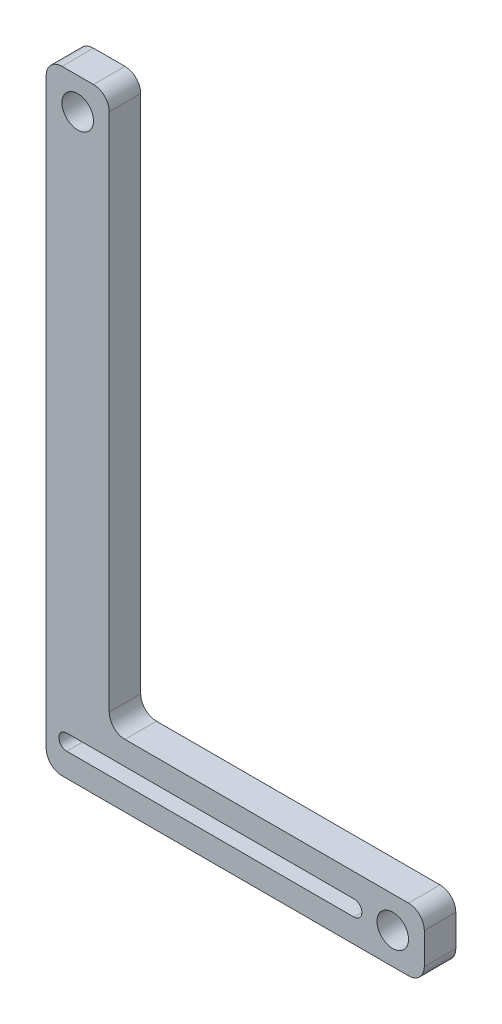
ISO-10303-21;
HEADER;
FILE_DESCRIPTION(('STEP AP214'),'2;1');
FILE_NAME('part.step','',(''),(''),'','','');
FILE_SCHEMA(('AUTOMOTIVE_DESIGN { 1 0 10303 214 1 1 1 1 }'));
ENDSEC;
DATA;
#1=APPLICATION_CONTEXT('core data for automotive mechanical design processes');
#2=APPLICATION_PROTOCOL_DEFINITION('international standard','automotive_design',2000,#1);
#3=PRODUCT_CONTEXT('',#1,'mechanical');
#4=PRODUCT('Part','Part','',(#3));
#5=PRODUCT_RELATED_PRODUCT_CATEGORY('part','',(#4));
#6=PRODUCT_DEFINITION_FORMATION('','',#4);
#7=PRODUCT_DEFINITION_CONTEXT('part definition',#1,'design');
#8=PRODUCT_DEFINITION('design','',#6,#7);
#9=PRODUCT_DEFINITION_SHAPE('','',#8);
#10=(LENGTH_UNIT() NAMED_UNIT(*) SI_UNIT(.MILLI.,.METRE.));
#11=(NAMED_UNIT(*) PLANE_ANGLE_UNIT() SI_UNIT($,.RADIAN.));
#12=(NAMED_UNIT(*) SI_UNIT($,.STERADIAN.) SOLID_ANGLE_UNIT());
#13=UNCERTAINTY_MEASURE_WITH_UNIT(LENGTH_MEASURE(1.E-05),#10,'distance_accuracy_value','');
#14=(GEOMETRIC_REPRESENTATION_CONTEXT(3) GLOBAL_UNCERTAINTY_ASSIGNED_CONTEXT((#13)) GLOBAL_UNIT_ASSIGNED_CONTEXT((#10,
#11,#12)) REPRESENTATION_CONTEXT('',''));
#15=CARTESIAN_POINT('',(0.,0.,0.));
#16=DIRECTION('',(0.,0.,1.));
#17=DIRECTION('',(1.,0.,0.));
#18=AXIS2_PLACEMENT_3D('',#15,#16,#17);
#19=CARTESIAN_POINT('',(0.,0.,-12.7));
#20=DIRECTION('',(0.,-1.,0.));
#21=DIRECTION('',(0.,0.,-1.));
#22=AXIS2_PLACEMENT_3D('',#19,#20,#21);
#23=PLANE('',#22);
#24=DIRECTION('',(1.,0.,0.));
#25=VECTOR('',#24,1.);
#26=CARTESIAN_POINT('',(0.,0.,-12.7));
#27=LINE('',#26,#25);
#28=CARTESIAN_POINT('',(-145.270175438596,0.,-12.7));
#29=VERTEX_POINT('',#28);
#30=CARTESIAN_POINT('',(-5.57017543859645,0.,-12.7));
#31=VERTEX_POINT('',#30);
#32=EDGE_CURVE('E191',#29,#31,#27,.T.);
#33=ORIENTED_EDGE('',*,*,#32,.T.);
#34=DIRECTION('',(0.,0.,1.));
#35=VECTOR('',#34,1.);
#36=CARTESIAN_POINT('',(-5.57017543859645,0.,-12.7));
#37=LINE('',#36,#35);
#38=CARTESIAN_POINT('',(-5.57017543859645,0.,0.));
#39=VERTEX_POINT('',#38);
#40=EDGE_CURVE('E233',#31,#39,#37,.T.);
#41=ORIENTED_EDGE('',*,*,#40,.T.);
#42=DIRECTION('',(1.,0.,0.));
#43=VECTOR('',#42,1.);
#44=CARTESIAN_POINT('',(0.,0.,0.));
#45=LINE('',#44,#43);
#46=CARTESIAN_POINT('',(-145.270175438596,0.,0.));
#47=VERTEX_POINT('',#46);
#48=EDGE_CURVE('E215',#47,#39,#45,.T.);
#49=ORIENTED_EDGE('',*,*,#48,.F.);
#50=DIRECTION('',(0.,0.,1.));
#51=VECTOR('',#50,1.);
#52=CARTESIAN_POINT('',(-145.270175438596,0.,-12.7));
#53=LINE('',#52,#51);
#54=EDGE_CURVE('E209',#47,#29,#53,.F.);
#55=ORIENTED_EDGE('',*,*,#54,.T.);
#56=EDGE_LOOP('',(#33,#41,#49,#55));
#57=FACE_BOUND('',#56,.T.);
#58=ADVANCED_FACE('F35',(#57),#23,.T.);
#59=CARTESIAN_POINT('',(-151.620175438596,0.,-12.7));
#60=DIRECTION('',(-1.,0.,0.));
#61=DIRECTION('',(0.,0.,1.));
#62=AXIS2_PLACEMENT_3D('',#59,#60,#61);
#63=PLANE('',#62);
#64=DIRECTION('',(0.,-1.,0.));
#65=VECTOR('',#64,1.);
#66=CARTESIAN_POINT('',(-151.620175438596,0.,-12.7));
#67=LINE('',#66,#65);
#68=CARTESIAN_POINT('',(-151.620175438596,241.3,-12.7));
#69=VERTEX_POINT('',#68);
#70=CARTESIAN_POINT('',(-151.620175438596,6.35,-12.7));
#71=VERTEX_POINT('',#70);
#72=EDGE_CURVE('E206',#69,#71,#67,.T.);
#73=ORIENTED_EDGE('',*,*,#72,.T.);
#74=DIRECTION('',(0.,0.,1.));
#75=VECTOR('',#74,1.);
#76=CARTESIAN_POINT('',(-151.620175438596,6.35,-12.7));
#77=LINE('',#76,#75);
#78=CARTESIAN_POINT('',(-151.620175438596,6.35,0.));
#79=VERTEX_POINT('',#78);
#80=EDGE_CURVE('E268',#71,#79,#77,.T.);
#81=ORIENTED_EDGE('',*,*,#80,.T.);
#82=DIRECTION('',(0.,-1.,0.));
#83=VECTOR('',#82,1.);
#84=CARTESIAN_POINT('',(-151.620175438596,0.,0.));
#85=LINE('',#84,#83);
#86=CARTESIAN_POINT('',(-151.620175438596,241.3,0.));
#87=VERTEX_POINT('',#86);
#88=EDGE_CURVE('E188',#87,#79,#85,.T.);
#89=ORIENTED_EDGE('',*,*,#88,.F.);
#90=DIRECTION('',(0.,0.,1.));
#91=VECTOR('',#90,1.);
#92=CARTESIAN_POINT('',(-151.620175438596,241.3,-12.7));
#93=LINE('',#92,#91);
#94=EDGE_CURVE('E266',#87,#69,#93,.F.);
#95=ORIENTED_EDGE('',*,*,#94,.T.);
#96=EDGE_LOOP('',(#73,#81,#89,#95));
#97=FACE_BOUND('',#96,.T.);
#98=ADVANCED_FACE('F322',(#97),#63,.T.);
#99=CARTESIAN_POINT('',(-2.70616862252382E-13,247.65,-12.7));
#100=DIRECTION('',(0.,-1.,0.));
#101=DIRECTION('',(1.,0.,0.));
#102=AXIS2_PLACEMENT_3D('',#99,#100,#101);
#103=PLANE('',#102);
#104=DIRECTION('',(1.,0.,0.));
#105=VECTOR('',#104,1.);
#106=CARTESIAN_POINT('',(-2.70616862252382E-13,247.65,-12.7));
#107=LINE('',#106,#105);
#108=CARTESIAN_POINT('',(-145.270175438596,247.65,-12.7));
#109=VERTEX_POINT('',#108);
#110=CARTESIAN_POINT('',(-132.570175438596,247.65,-12.7));
#111=VERTEX_POINT('',#110);
#112=EDGE_CURVE('E203',#109,#111,#107,.T.);
#113=ORIENTED_EDGE('',*,*,#112,.F.);
#114=DIRECTION('',(0.,0.,1.));
#115=VECTOR('',#114,1.);
#116=CARTESIAN_POINT('',(-145.270175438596,247.65,0.));
#117=LINE('',#116,#115);
#118=CARTESIAN_POINT('',(-145.270175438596,247.65,0.));
#119=VERTEX_POINT('',#118);
#120=EDGE_CURVE('E278',#109,#119,#117,.T.);
#121=ORIENTED_EDGE('',*,*,#120,.T.);
#122=DIRECTION('',(1.,0.,0.));
#123=VECTOR('',#122,1.);
#124=CARTESIAN_POINT('',(-2.70616862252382E-13,247.65,0.));
#125=LINE('',#124,#123);
#126=CARTESIAN_POINT('',(-132.570175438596,247.65,0.));
#127=VERTEX_POINT('',#126);
#128=EDGE_CURVE('E227',#119,#127,#125,.T.);
#129=ORIENTED_EDGE('',*,*,#128,.T.);
#130=DIRECTION('',(0.,0.,1.));
#131=VECTOR('',#130,1.);
#132=CARTESIAN_POINT('',(-132.570175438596,247.65,-12.7));
#133=LINE('',#132,#131);
#134=EDGE_CURVE('E276',#127,#111,#133,.F.);
#135=ORIENTED_EDGE('',*,*,#134,.T.);
#136=EDGE_LOOP('',(#113,#121,#129,#135));
#137=FACE_BOUND('',#136,.T.);
#138=ADVANCED_FACE('F331',(#137),#103,.F.);
#139=CARTESIAN_POINT('',(-126.220175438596,0.,-12.7));
#140=DIRECTION('',(-1.,0.,0.));
#141=DIRECTION('',(0.,0.,1.));
#142=AXIS2_PLACEMENT_3D('',#139,#140,#141);
#143=PLANE('',#142);
#144=DIRECTION('',(0.,-1.,0.));
#145=VECTOR('',#144,1.);
#146=CARTESIAN_POINT('',(-126.220175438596,0.,0.));
#147=LINE('',#146,#145);
#148=CARTESIAN_POINT('',(-126.220175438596,241.3,0.));
#149=VERTEX_POINT('',#148);
#150=CARTESIAN_POINT('',(-126.220175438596,31.75,0.));
#151=VERTEX_POINT('',#150);
#152=EDGE_CURVE('E224',#149,#151,#147,.T.);
#153=ORIENTED_EDGE('',*,*,#152,.T.);
#154=DIRECTION('',(0.,0.,1.));
#155=VECTOR('',#154,1.);
#156=CARTESIAN_POINT('',(-126.220175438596,31.75,-12.7));
#157=LINE('',#156,#155);
#158=CARTESIAN_POINT('',(-126.220175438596,31.75,-12.7));
#159=VERTEX_POINT('',#158);
#160=EDGE_CURVE('E274',#151,#159,#157,.F.);
#161=ORIENTED_EDGE('',*,*,#160,.T.);
#162=DIRECTION('',(0.,-1.,0.));
#163=VECTOR('',#162,1.);
#164=CARTESIAN_POINT('',(-126.220175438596,0.,-12.7));
#165=LINE('',#164,#163);
#166=CARTESIAN_POINT('',(-126.220175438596,241.3,-12.7));
#167=VERTEX_POINT('',#166);
#168=EDGE_CURVE('E200',#167,#159,#165,.T.);
#169=ORIENTED_EDGE('',*,*,#168,.F.);
#170=DIRECTION('',(0.,0.,1.));
#171=VECTOR('',#170,1.);
#172=CARTESIAN_POINT('',(-126.220175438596,241.3,-12.7));
#173=LINE('',#172,#171);
#174=EDGE_CURVE('E271',#167,#149,#173,.T.);
#175=ORIENTED_EDGE('',*,*,#174,.T.);
#176=EDGE_LOOP('',(#153,#161,#169,#175));
#177=FACE_BOUND('',#176,.T.);
#178=ADVANCED_FACE('F287',(#177),#143,.F.);
#179=CARTESIAN_POINT('',(0.,25.4,-12.7));
#180=DIRECTION('',(0.,-1.,0.));
#181=DIRECTION('',(1.,0.,0.));
#182=AXIS2_PLACEMENT_3D('',#179,#180,#181);
#183=PLANE('',#182);
#184=DIRECTION('',(1.,0.,0.));
#185=VECTOR('',#184,1.);
#186=CARTESIAN_POINT('',(0.,25.4,0.));
#187=LINE('',#186,#185);
#188=CARTESIAN_POINT('',(-119.870175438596,25.4,0.));
#189=VERTEX_POINT('',#188);
#190=CARTESIAN_POINT('',(-5.57017543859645,25.4,0.));
#191=VERTEX_POINT('',#190);
#192=EDGE_CURVE('E221',#189,#191,#187,.T.);
#193=ORIENTED_EDGE('',*,*,#192,.T.);
#194=DIRECTION('',(0.,0.,1.));
#195=VECTOR('',#194,1.);
#196=CARTESIAN_POINT('',(-5.57017543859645,25.4,-12.7));
#197=LINE('',#196,#195);
#198=CARTESIAN_POINT('',(-5.57017543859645,25.4,-12.7));
#199=VERTEX_POINT('',#198);
#200=EDGE_CURVE('E264',#191,#199,#197,.F.);
#201=ORIENTED_EDGE('',*,*,#200,.T.);
#202=DIRECTION('',(1.,0.,0.));
#203=VECTOR('',#202,1.);
#204=CARTESIAN_POINT('',(0.,25.4,-12.7));
#205=LINE('',#204,#203);
#206=CARTESIAN_POINT('',(-119.870175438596,25.4,-12.7));
#207=VERTEX_POINT('',#206);
#208=EDGE_CURVE('E197',#207,#199,#205,.T.);
#209=ORIENTED_EDGE('',*,*,#208,.F.);
#210=DIRECTION('',(0.,0.,1.));
#211=VECTOR('',#210,1.);
#212=CARTESIAN_POINT('',(-119.870175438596,25.4,0.));
#213=LINE('',#212,#211);
#214=EDGE_CURVE('E261',#207,#189,#213,.T.);
#215=ORIENTED_EDGE('',*,*,#214,.T.);
#216=EDGE_LOOP('',(#193,#201,#209,#215));
#217=FACE_BOUND('',#216,.T.);
#218=ADVANCED_FACE('F298',(#217),#183,.F.);
#219=CARTESIAN_POINT('',(-11.9201754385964,12.7,-12.7));
#220=DIRECTION('',(0.,0.,1.));
#221=DIRECTION('',(1.,0.,0.));
#222=AXIS2_PLACEMENT_3D('',#219,#220,#221);
#223=CYLINDRICAL_SURFACE('',#222,6.35);
#224=CARTESIAN_POINT('',(-11.9201754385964,12.7,-12.7));
#225=DIRECTION('',(0.,0.,1.));
#226=DIRECTION('',(1.,0.,0.));
#227=AXIS2_PLACEMENT_3D('',#224,#225,#226);
#228=CIRCLE('',#227,6.35);
#229=CARTESIAN_POINT('',(-5.57017543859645,12.7,-12.7));
#230=VERTEX_POINT('',#229);
#231=EDGE_CURVE('E187',#230,#230,#228,.T.);
#232=ORIENTED_EDGE('',*,*,#231,.F.);
#233=EDGE_LOOP('',(#232));
#234=FACE_BOUND('',#233,.T.);
#235=CARTESIAN_POINT('',(-11.9201754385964,12.7,0.));
#236=DIRECTION('',(0.,0.,1.));
#237=DIRECTION('',(1.,0.,0.));
#238=AXIS2_PLACEMENT_3D('',#235,#236,#237);
#239=CIRCLE('',#238,6.35);
#240=CARTESIAN_POINT('',(-5.57017543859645,12.7,0.));
#241=VERTEX_POINT('',#240);
#242=EDGE_CURVE('E212',#241,#241,#239,.T.);
#243=ORIENTED_EDGE('',*,*,#242,.T.);
#244=EDGE_LOOP('',(#243));
#245=FACE_BOUND('',#244,.T.);
#246=ADVANCED_FACE('F351',(#234,#245),#223,.F.);
#247=CARTESIAN_POINT('',(-138.920175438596,234.95,-12.7));
#248=DIRECTION('',(0.,0.,1.));
#249=DIRECTION('',(1.,0.,0.));
#250=AXIS2_PLACEMENT_3D('',#247,#248,#249);
#251=CYLINDRICAL_SURFACE('',#250,6.34999999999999);
#252=CARTESIAN_POINT('',(-138.920175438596,234.95,-12.7));
#253=DIRECTION('',(0.,0.,1.));
#254=DIRECTION('',(1.,0.,0.));
#255=AXIS2_PLACEMENT_3D('',#252,#253,#254);
#256=CIRCLE('',#255,6.34999999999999);
#257=CARTESIAN_POINT('',(-132.570175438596,234.95,-12.7));
#258=VERTEX_POINT('',#257);
#259=EDGE_CURVE('E184',#258,#258,#256,.T.);
#260=ORIENTED_EDGE('',*,*,#259,.F.);
#261=EDGE_LOOP('',(#260));
#262=FACE_BOUND('',#261,.T.);
#263=CARTESIAN_POINT('',(-138.920175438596,234.95,0.));
#264=DIRECTION('',(0.,0.,1.));
#265=DIRECTION('',(1.,0.,0.));
#266=AXIS2_PLACEMENT_3D('',#263,#264,#265);
#267=CIRCLE('',#266,6.34999999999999);
#268=CARTESIAN_POINT('',(-132.570175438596,234.95,0.));
#269=VERTEX_POINT('',#268);
#270=EDGE_CURVE('E180',#269,#269,#267,.T.);
#271=ORIENTED_EDGE('',*,*,#270,.T.);
#272=EDGE_LOOP('',(#271));
#273=FACE_BOUND('',#272,.T.);
#274=ADVANCED_FACE('F354',(#262,#273),#251,.F.);
#275=CARTESIAN_POINT('',(0.779824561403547,0.,-12.7));
#276=DIRECTION('',(1.,0.,0.));
#277=DIRECTION('',(0.,1.,0.));
#278=AXIS2_PLACEMENT_3D('',#275,#276,#277);
#279=PLANE('',#278);
#280=DIRECTION('',(0.,1.,0.));
#281=VECTOR('',#280,1.);
#282=CARTESIAN_POINT('',(0.779824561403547,0.,0.));
#283=LINE('',#282,#281);
#284=CARTESIAN_POINT('',(0.779824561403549,6.35,0.));
#285=VERTEX_POINT('',#284);
#286=CARTESIAN_POINT('',(0.779824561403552,19.05,0.));
#287=VERTEX_POINT('',#286);
#288=EDGE_CURVE('E218',#285,#287,#283,.T.);
#289=ORIENTED_EDGE('',*,*,#288,.F.);
#290=DIRECTION('',(0.,0.,1.));
#291=VECTOR('',#290,1.);
#292=CARTESIAN_POINT('',(0.779824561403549,6.35,-12.7));
#293=LINE('',#292,#291);
#294=CARTESIAN_POINT('',(0.779824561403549,6.35,-12.7));
#295=VERTEX_POINT('',#294);
#296=EDGE_CURVE('E249',#285,#295,#293,.F.);
#297=ORIENTED_EDGE('',*,*,#296,.T.);
#298=DIRECTION('',(0.,1.,0.));
#299=VECTOR('',#298,1.);
#300=CARTESIAN_POINT('',(0.779824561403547,0.,-12.7));
#301=LINE('',#300,#299);
#302=CARTESIAN_POINT('',(0.779824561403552,19.05,-12.7));
#303=VERTEX_POINT('',#302);
#304=EDGE_CURVE('E194',#295,#303,#301,.T.);
#305=ORIENTED_EDGE('',*,*,#304,.T.);
#306=DIRECTION('',(0.,0.,1.));
#307=VECTOR('',#306,1.);
#308=CARTESIAN_POINT('',(0.779824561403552,19.05,0.));
#309=LINE('',#308,#307);
#310=EDGE_CURVE('E246',#303,#287,#309,.T.);
#311=ORIENTED_EDGE('',*,*,#310,.T.);
#312=EDGE_LOOP('',(#289,#297,#305,#311));
#313=FACE_BOUND('',#312,.T.);
#314=ADVANCED_FACE('F306',(#313),#279,.T.);
#315=CARTESIAN_POINT('',(0.,0.,-12.7));
#316=DIRECTION('',(0.,0.,1.));
#317=DIRECTION('',(1.,0.,0.));
#318=AXIS2_PLACEMENT_3D('',#315,#316,#317);
#319=PLANE('',#318);
#320=DIRECTION('',(-1.,0.,0.));
#321=VECTOR('',#320,1.);
#322=CARTESIAN_POINT('',(-27.5413425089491,9.525,-12.7));
#323=LINE('',#322,#321);
#324=CARTESIAN_POINT('',(-27.5413425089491,9.525,-12.7));
#325=VERTEX_POINT('',#324);
#326=CARTESIAN_POINT('',(-143.360549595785,9.525,-12.7));
#327=VERTEX_POINT('',#326);
#328=EDGE_CURVE('E174',#325,#327,#323,.T.);
#329=ORIENTED_EDGE('',*,*,#328,.F.);
#330=CARTESIAN_POINT('',(-27.5413425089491,12.7,-12.7));
#331=DIRECTION('',(0.,0.,-1.));
#332=DIRECTION('',(-1.,0.,0.));
#333=AXIS2_PLACEMENT_3D('',#330,#331,#332);
#334=CIRCLE('',#333,3.175);
#335=CARTESIAN_POINT('',(-27.5413425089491,15.875,-12.7));
#336=VERTEX_POINT('',#335);
#337=EDGE_CURVE('E50',#336,#325,#334,.T.);
#338=ORIENTED_EDGE('',*,*,#337,.F.);
#339=DIRECTION('',(1.,0.,0.));
#340=VECTOR('',#339,1.);
#341=CARTESIAN_POINT('',(-27.5413425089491,15.875,-12.7));
#342=LINE('',#341,#340);
#343=CARTESIAN_POINT('',(-143.360549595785,15.875,-12.7));
#344=VERTEX_POINT('',#343);
#345=EDGE_CURVE('E165',#344,#336,#342,.T.);
#346=ORIENTED_EDGE('',*,*,#345,.F.);
#347=CARTESIAN_POINT('',(-143.360549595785,12.7,-12.7));
#348=DIRECTION('',(0.,0.,-1.));
#349=DIRECTION('',(-1.,0.,0.));
#350=AXIS2_PLACEMENT_3D('',#347,#348,#349);
#351=CIRCLE('',#350,3.175);
#352=EDGE_CURVE('E168',#327,#344,#351,.T.);
#353=ORIENTED_EDGE('',*,*,#352,.F.);
#354=EDGE_LOOP('',(#329,#338,#346,#353));
#355=FACE_BOUND('',#354,.T.);
#356=ORIENTED_EDGE('',*,*,#259,.T.);
#357=EDGE_LOOP('',(#356));
#358=FACE_BOUND('',#357,.T.);
#359=ORIENTED_EDGE('',*,*,#231,.T.);
#360=EDGE_LOOP('',(#359));
#361=FACE_BOUND('',#360,.T.);
#362=ORIENTED_EDGE('',*,*,#304,.F.);
#363=CARTESIAN_POINT('',(-5.57017543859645,6.35,-12.7));
#364=DIRECTION('',(0.,0.,1.));
#365=DIRECTION('',(1.,0.,0.));
#366=AXIS2_PLACEMENT_3D('',#363,#364,#365);
#367=CIRCLE('',#366,6.35);
#368=EDGE_CURVE('E259',#295,#31,#367,.F.);
#369=ORIENTED_EDGE('',*,*,#368,.T.);
#370=ORIENTED_EDGE('',*,*,#32,.F.);
#371=CARTESIAN_POINT('',(-145.270175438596,6.35,-12.7));
#372=DIRECTION('',(0.,0.,1.));
#373=DIRECTION('',(1.,0.,0.));
#374=AXIS2_PLACEMENT_3D('',#371,#372,#373);
#375=CIRCLE('',#374,6.35);
#376=EDGE_CURVE('E255',#29,#71,#375,.F.);
#377=ORIENTED_EDGE('',*,*,#376,.T.);
#378=ORIENTED_EDGE('',*,*,#72,.F.);
#379=CARTESIAN_POINT('',(-145.270175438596,241.3,-12.7));
#380=DIRECTION('',(0.,0.,1.));
#381=DIRECTION('',(1.,0.,0.));
#382=AXIS2_PLACEMENT_3D('',#379,#380,#381);
#383=CIRCLE('',#382,6.35);
#384=EDGE_CURVE('E253',#69,#109,#383,.F.);
#385=ORIENTED_EDGE('',*,*,#384,.T.);
#386=ORIENTED_EDGE('',*,*,#112,.T.);
#387=CARTESIAN_POINT('',(-132.570175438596,241.3,-12.7));
#388=DIRECTION('',(0.,0.,1.));
#389=DIRECTION('',(1.,0.,0.));
#390=AXIS2_PLACEMENT_3D('',#387,#388,#389);
#391=CIRCLE('',#390,6.35);
#392=EDGE_CURVE('E251',#111,#167,#391,.F.);
#393=ORIENTED_EDGE('',*,*,#392,.T.);
#394=ORIENTED_EDGE('',*,*,#168,.T.);
#395=CARTESIAN_POINT('',(-119.870175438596,31.75,-12.7));
#396=DIRECTION('',(0.,0.,1.));
#397=DIRECTION('',(1.,0.,0.));
#398=AXIS2_PLACEMENT_3D('',#395,#396,#397);
#399=CIRCLE('',#398,6.35);
#400=EDGE_CURVE('E11',#159,#207,#399,.T.);
#401=ORIENTED_EDGE('',*,*,#400,.T.);
#402=ORIENTED_EDGE('',*,*,#208,.T.);
#403=CARTESIAN_POINT('',(-5.57017543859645,19.05,-12.7));
#404=DIRECTION('',(0.,0.,1.));
#405=DIRECTION('',(1.,0.,0.));
#406=AXIS2_PLACEMENT_3D('',#403,#404,#405);
#407=CIRCLE('',#406,6.35);
#408=EDGE_CURVE('E257',#199,#303,#407,.F.);
#409=ORIENTED_EDGE('',*,*,#408,.T.);
#410=EDGE_LOOP('',(#362,#369,#370,#377,#378,#385,#386,#393,#394,#401,#402,#409));
#411=FACE_BOUND('',#410,.T.);
#412=ADVANCED_FACE('F295',(#355,#358,#361,#411),#319,.F.);
#413=CARTESIAN_POINT('',(0.,0.,0.));
#414=DIRECTION('',(0.,0.,1.));
#415=DIRECTION('',(1.,0.,0.));
#416=AXIS2_PLACEMENT_3D('',#413,#414,#415);
#417=PLANE('',#416);
#418=CARTESIAN_POINT('',(-27.5413425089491,12.7,0.));
#419=DIRECTION('',(0.,0.,-1.));
#420=DIRECTION('',(-1.,0.,0.));
#421=AXIS2_PLACEMENT_3D('',#418,#419,#420);
#422=CIRCLE('',#421,3.175);
#423=CARTESIAN_POINT('',(-27.5413425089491,15.875,0.));
#424=VERTEX_POINT('',#423);
#425=CARTESIAN_POINT('',(-27.5413425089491,9.525,0.));
#426=VERTEX_POINT('',#425);
#427=EDGE_CURVE('E149',#424,#426,#422,.T.);
#428=ORIENTED_EDGE('',*,*,#427,.T.);
#429=DIRECTION('',(-1.,0.,0.));
#430=VECTOR('',#429,1.);
#431=CARTESIAN_POINT('',(-27.5413425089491,9.525,0.));
#432=LINE('',#431,#430);
#433=CARTESIAN_POINT('',(-143.360549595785,9.525,0.));
#434=VERTEX_POINT('',#433);
#435=EDGE_CURVE('E158',#426,#434,#432,.T.);
#436=ORIENTED_EDGE('',*,*,#435,.T.);
#437=CARTESIAN_POINT('',(-143.360549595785,12.7,0.));
#438=DIRECTION('',(0.,0.,-1.));
#439=DIRECTION('',(-1.,0.,0.));
#440=AXIS2_PLACEMENT_3D('',#437,#438,#439);
#441=CIRCLE('',#440,3.175);
#442=CARTESIAN_POINT('',(-143.360549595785,15.875,0.));
#443=VERTEX_POINT('',#442);
#444=EDGE_CURVE('E58',#434,#443,#441,.T.);
#445=ORIENTED_EDGE('',*,*,#444,.T.);
#446=DIRECTION('',(1.,0.,0.));
#447=VECTOR('',#446,1.);
#448=CARTESIAN_POINT('',(-27.5413425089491,15.875,0.));
#449=LINE('',#448,#447);
#450=EDGE_CURVE('E155',#443,#424,#449,.T.);
#451=ORIENTED_EDGE('',*,*,#450,.T.);
#452=EDGE_LOOP('',(#428,#436,#445,#451));
#453=FACE_BOUND('',#452,.T.);
#454=ORIENTED_EDGE('',*,*,#270,.F.);
#455=EDGE_LOOP('',(#454));
#456=FACE_BOUND('',#455,.T.);
#457=ORIENTED_EDGE('',*,*,#242,.F.);
#458=EDGE_LOOP('',(#457));
#459=FACE_BOUND('',#458,.T.);
#460=ORIENTED_EDGE('',*,*,#48,.T.);
#461=CARTESIAN_POINT('',(-5.57017543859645,6.35,0.));
#462=DIRECTION('',(0.,0.,1.));
#463=DIRECTION('',(1.,0.,0.));
#464=AXIS2_PLACEMENT_3D('',#461,#462,#463);
#465=CIRCLE('',#464,6.35);
#466=EDGE_CURVE('E244',#39,#285,#465,.T.);
#467=ORIENTED_EDGE('',*,*,#466,.T.);
#468=ORIENTED_EDGE('',*,*,#288,.T.);
#469=CARTESIAN_POINT('',(-5.57017543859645,19.05,0.));
#470=DIRECTION('',(0.,0.,1.));
#471=DIRECTION('',(1.,0.,0.));
#472=AXIS2_PLACEMENT_3D('',#469,#470,#471);
#473=CIRCLE('',#472,6.35);
#474=EDGE_CURVE('E242',#287,#191,#473,.T.);
#475=ORIENTED_EDGE('',*,*,#474,.T.);
#476=ORIENTED_EDGE('',*,*,#192,.F.);
#477=CARTESIAN_POINT('',(-119.870175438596,31.75,0.));
#478=DIRECTION('',(0.,0.,1.));
#479=DIRECTION('',(1.,0.,0.));
#480=AXIS2_PLACEMENT_3D('',#477,#478,#479);
#481=CIRCLE('',#480,6.35);
#482=EDGE_CURVE('E43',#189,#151,#481,.F.);
#483=ORIENTED_EDGE('',*,*,#482,.T.);
#484=ORIENTED_EDGE('',*,*,#152,.F.);
#485=CARTESIAN_POINT('',(-132.570175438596,241.3,0.));
#486=DIRECTION('',(0.,0.,1.));
#487=DIRECTION('',(1.,0.,0.));
#488=AXIS2_PLACEMENT_3D('',#485,#486,#487);
#489=CIRCLE('',#488,6.35);
#490=EDGE_CURVE('E236',#149,#127,#489,.T.);
#491=ORIENTED_EDGE('',*,*,#490,.T.);
#492=ORIENTED_EDGE('',*,*,#128,.F.);
#493=CARTESIAN_POINT('',(-145.270175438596,241.3,0.));
#494=DIRECTION('',(0.,0.,1.));
#495=DIRECTION('',(1.,0.,0.));
#496=AXIS2_PLACEMENT_3D('',#493,#494,#495);
#497=CIRCLE('',#496,6.35);
#498=EDGE_CURVE('E238',#119,#87,#497,.T.);
#499=ORIENTED_EDGE('',*,*,#498,.T.);
#500=ORIENTED_EDGE('',*,*,#88,.T.);
#501=CARTESIAN_POINT('',(-145.270175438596,6.35,0.));
#502=DIRECTION('',(0.,0.,1.));
#503=DIRECTION('',(1.,0.,0.));
#504=AXIS2_PLACEMENT_3D('',#501,#502,#503);
#505=CIRCLE('',#504,6.35);
#506=EDGE_CURVE('E240',#79,#47,#505,.T.);
#507=ORIENTED_EDGE('',*,*,#506,.T.);
#508=EDGE_LOOP('',(#460,#467,#468,#475,#476,#483,#484,#491,#492,#499,#500,#507));
#509=FACE_BOUND('',#508,.T.);
#510=ADVANCED_FACE('F162',(#453,#456,#459,#509),#417,.T.);
#511=CARTESIAN_POINT('',(-5.57017543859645,6.35,-12.7));
#512=DIRECTION('',(0.,0.,1.));
#513=DIRECTION('',(1.,0.,0.));
#514=AXIS2_PLACEMENT_3D('',#511,#512,#513);
#515=CYLINDRICAL_SURFACE('',#514,6.35);
#516=ORIENTED_EDGE('',*,*,#368,.F.);
#517=ORIENTED_EDGE('',*,*,#296,.F.);
#518=ORIENTED_EDGE('',*,*,#466,.F.);
#519=ORIENTED_EDGE('',*,*,#40,.F.);
#520=EDGE_LOOP('',(#516,#517,#518,#519));
#521=FACE_BOUND('',#520,.T.);
#522=ADVANCED_FACE('F309',(#521),#515,.T.);
#523=CARTESIAN_POINT('',(-5.57017543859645,19.05,-12.7));
#524=DIRECTION('',(0.,0.,-1.));
#525=DIRECTION('',(-1.,0.,0.));
#526=AXIS2_PLACEMENT_3D('',#523,#524,#525);
#527=CYLINDRICAL_SURFACE('',#526,6.35);
#528=ORIENTED_EDGE('',*,*,#408,.F.);
#529=ORIENTED_EDGE('',*,*,#200,.F.);
#530=ORIENTED_EDGE('',*,*,#474,.F.);
#531=ORIENTED_EDGE('',*,*,#310,.F.);
#532=EDGE_LOOP('',(#528,#529,#530,#531));
#533=FACE_BOUND('',#532,.T.);
#534=ADVANCED_FACE('F301',(#533),#527,.T.);
#535=CARTESIAN_POINT('',(-145.270175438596,6.35,-12.7));
#536=DIRECTION('',(0.,0.,1.));
#537=DIRECTION('',(1.,0.,0.));
#538=AXIS2_PLACEMENT_3D('',#535,#536,#537);
#539=CYLINDRICAL_SURFACE('',#538,6.35);
#540=ORIENTED_EDGE('',*,*,#376,.F.);
#541=ORIENTED_EDGE('',*,*,#54,.F.);
#542=ORIENTED_EDGE('',*,*,#506,.F.);
#543=ORIENTED_EDGE('',*,*,#80,.F.);
#544=EDGE_LOOP('',(#540,#541,#542,#543));
#545=FACE_BOUND('',#544,.T.);
#546=ADVANCED_FACE('F317',(#545),#539,.T.);
#547=CARTESIAN_POINT('',(-119.870175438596,31.75,-12.7));
#548=DIRECTION('',(0.,0.,-1.));
#549=DIRECTION('',(-1.,0.,0.));
#550=AXIS2_PLACEMENT_3D('',#547,#548,#549);
#551=CYLINDRICAL_SURFACE('',#550,6.35);
#552=ORIENTED_EDGE('',*,*,#400,.F.);
#553=ORIENTED_EDGE('',*,*,#160,.F.);
#554=ORIENTED_EDGE('',*,*,#482,.F.);
#555=ORIENTED_EDGE('',*,*,#214,.F.);
#556=EDGE_LOOP('',(#552,#553,#554,#555));
#557=FACE_BOUND('',#556,.T.);
#558=ADVANCED_FACE('F291',(#557),#551,.F.);
#559=CARTESIAN_POINT('',(-145.270175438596,241.3,-12.7));
#560=DIRECTION('',(0.,0.,-1.));
#561=DIRECTION('',(-1.,0.,0.));
#562=AXIS2_PLACEMENT_3D('',#559,#560,#561);
#563=CYLINDRICAL_SURFACE('',#562,6.35);
#564=ORIENTED_EDGE('',*,*,#384,.F.);
#565=ORIENTED_EDGE('',*,*,#94,.F.);
#566=ORIENTED_EDGE('',*,*,#498,.F.);
#567=ORIENTED_EDGE('',*,*,#120,.F.);
#568=EDGE_LOOP('',(#564,#565,#566,#567));
#569=FACE_BOUND('',#568,.T.);
#570=ADVANCED_FACE('F326',(#569),#563,.T.);
#571=CARTESIAN_POINT('',(-132.570175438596,241.3,-12.7));
#572=DIRECTION('',(0.,0.,1.));
#573=DIRECTION('',(1.,0.,0.));
#574=AXIS2_PLACEMENT_3D('',#571,#572,#573);
#575=CYLINDRICAL_SURFACE('',#574,6.35);
#576=ORIENTED_EDGE('',*,*,#392,.F.);
#577=ORIENTED_EDGE('',*,*,#134,.F.);
#578=ORIENTED_EDGE('',*,*,#490,.F.);
#579=ORIENTED_EDGE('',*,*,#174,.F.);
#580=EDGE_LOOP('',(#576,#577,#578,#579));
#581=FACE_BOUND('',#580,.T.);
#582=ADVANCED_FACE('F37',(#581),#575,.T.);
#583=CARTESIAN_POINT('',(-27.5413425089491,12.7,0.));
#584=DIRECTION('',(0.,0.,-1.));
#585=DIRECTION('',(-1.,0.,0.));
#586=AXIS2_PLACEMENT_3D('',#583,#584,#585);
#587=CYLINDRICAL_SURFACE('',#586,3.175);
#588=ORIENTED_EDGE('',*,*,#337,.T.);
#589=DIRECTION('',(0.,0.,-1.));
#590=VECTOR('',#589,1.);
#591=CARTESIAN_POINT('',(-27.5413425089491,9.525,0.));
#592=LINE('',#591,#590);
#593=EDGE_CURVE('E145',#426,#325,#592,.T.);
#594=ORIENTED_EDGE('',*,*,#593,.F.);
#595=ORIENTED_EDGE('',*,*,#427,.F.);
#596=DIRECTION('',(0.,0.,-1.));
#597=VECTOR('',#596,1.);
#598=CARTESIAN_POINT('',(-27.5413425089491,15.875,0.));
#599=LINE('',#598,#597);
#600=EDGE_CURVE('E178',#424,#336,#599,.T.);
#601=ORIENTED_EDGE('',*,*,#600,.T.);
#602=EDGE_LOOP('',(#588,#594,#595,#601));
#603=FACE_BOUND('',#602,.T.);
#604=ADVANCED_FACE('F147',(#603),#587,.F.);
#605=CARTESIAN_POINT('',(-27.5413425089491,15.875,0.));
#606=DIRECTION('',(0.,1.,0.));
#607=DIRECTION('',(0.,0.,1.));
#608=AXIS2_PLACEMENT_3D('',#605,#606,#607);
#609=PLANE('',#608);
#610=ORIENTED_EDGE('',*,*,#345,.T.);
#611=ORIENTED_EDGE('',*,*,#600,.F.);
#612=ORIENTED_EDGE('',*,*,#450,.F.);
#613=DIRECTION('',(0.,0.,-1.));
#614=VECTOR('',#613,1.);
#615=CARTESIAN_POINT('',(-143.360549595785,15.875,0.));
#616=LINE('',#615,#614);
#617=EDGE_CURVE('E181',#443,#344,#616,.T.);
#618=ORIENTED_EDGE('',*,*,#617,.T.);
#619=EDGE_LOOP('',(#610,#611,#612,#618));
#620=FACE_BOUND('',#619,.T.);
#621=ADVANCED_FACE('F340',(#620),#609,.F.);
#622=CARTESIAN_POINT('',(-143.360549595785,12.7,0.));
#623=DIRECTION('',(0.,0.,-1.));
#624=DIRECTION('',(-1.,0.,0.));
#625=AXIS2_PLACEMENT_3D('',#622,#623,#624);
#626=CYLINDRICAL_SURFACE('',#625,3.175);
#627=ORIENTED_EDGE('',*,*,#352,.T.);
#628=ORIENTED_EDGE('',*,*,#617,.F.);
#629=ORIENTED_EDGE('',*,*,#444,.F.);
#630=DIRECTION('',(0.,0.,-1.));
#631=VECTOR('',#630,1.);
#632=CARTESIAN_POINT('',(-143.360549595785,9.525,0.));
#633=LINE('',#632,#631);
#634=EDGE_CURVE('E154',#434,#327,#633,.T.);
#635=ORIENTED_EDGE('',*,*,#634,.T.);
#636=EDGE_LOOP('',(#627,#628,#629,#635));
#637=FACE_BOUND('',#636,.T.);
#638=ADVANCED_FACE('F413',(#637),#626,.F.);
#639=CARTESIAN_POINT('',(-27.5413425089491,9.525,0.));
#640=DIRECTION('',(0.,-1.,0.));
#641=DIRECTION('',(0.,0.,-1.));
#642=AXIS2_PLACEMENT_3D('',#639,#640,#641);
#643=PLANE('',#642);
#644=ORIENTED_EDGE('',*,*,#328,.T.);
#645=ORIENTED_EDGE('',*,*,#634,.F.);
#646=ORIENTED_EDGE('',*,*,#435,.F.);
#647=ORIENTED_EDGE('',*,*,#593,.T.);
#648=EDGE_LOOP('',(#644,#645,#646,#647));
#649=FACE_BOUND('',#648,.T.);
#650=ADVANCED_FACE('F159',(#649),#643,.F.);
#651=CLOSED_SHELL('',(#58,#98,#138,#178,#218,#246,#274,#314,#412,#510,#522,#534,#546,#558,#570,
#582,#604,#621,#638,#650));
#652=MANIFOLD_SOLID_BREP('B2',#651);
#653=ADVANCED_BREP_SHAPE_REPRESENTATION('',(#18,#652),#14);
#654=SHAPE_DEFINITION_REPRESENTATION(#9,#653);
ENDSEC;
END-ISO-10303-21;
